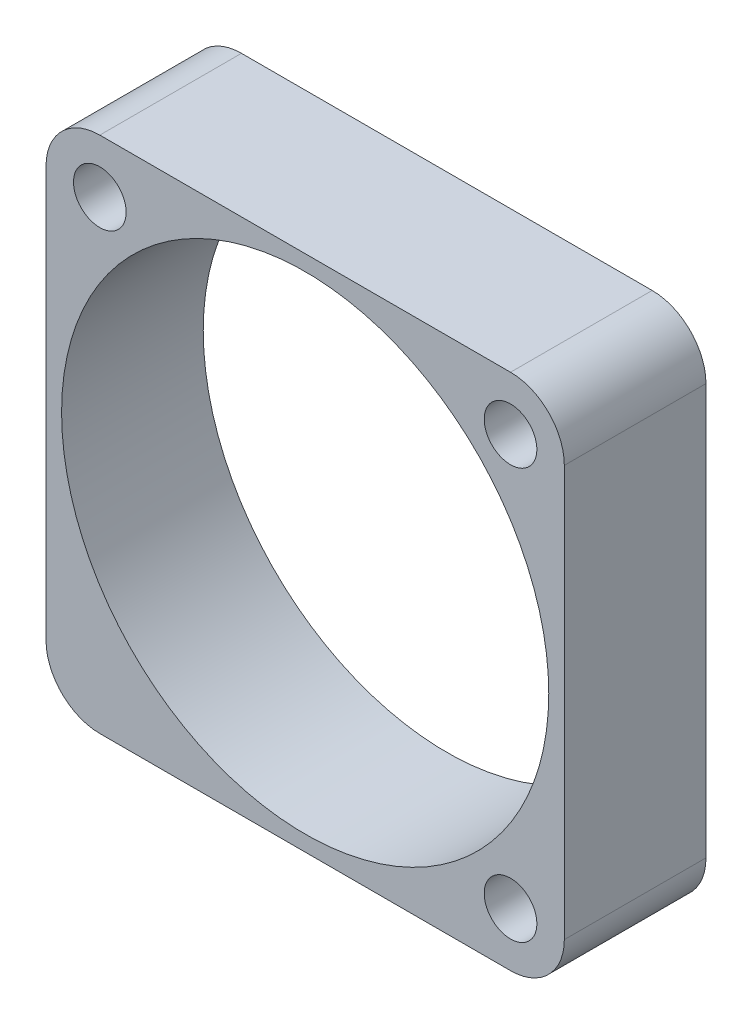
from build123d import *

# Parameters (mm, degrees)
SKETCH1_W           = 25
SKETCH1_H           = 25
BOSS_EXTRUDE1_DEPTH = 6.8325
SKETCH2_R           = 11.75
CUT_EXTRUDE1_DEPTH  = 37.009485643
SKETCH3_R           = 1.27
CUT_EXTRUDE2_DEPTH  = 37.009485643
CUT_EXTRUDE3_DEPTH  = 37.009485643


with BuildPart() as part:
    # Sketch1 → Boss-Extrude1 (new body)
    with BuildSketch(Plane.XY):
        with Locations((12.5, 12.5)):
            Rectangle(SKETCH1_W, SKETCH1_H)
    extrude(amount=BOSS_EXTRUDE1_DEPTH)

    # Sketch2 → Cut-Extrude1 (cut, through all)
    with BuildSketch(Plane.XY.offset(6.8325)):
        with Locations((12.5, 12.5)):
            Circle(SKETCH2_R)
    extrude(amount=-CUT_EXTRUDE1_DEPTH, mode=Mode.SUBTRACT)

    # Sketch3 → Cut-Extrude2 (cut, through all)
    with BuildSketch(Plane.XY.offset(6.8325)):
        with Locations((2.594, 22.406)):
            Circle(SKETCH3_R)
        with Locations((22.406, 22.406)):
            Circle(SKETCH3_R)
        with Locations((22.406, 2.594)):
            Circle(SKETCH3_R)
    extrude(amount=-CUT_EXTRUDE2_DEPTH, mode=Mode.SUBTRACT)

    # Sketch4 → Cut-Extrude3 (cut, through all)
    with BuildSketch(Plane.XY.offset(6.8325)):
        with BuildLine():
            Line((22.406, 25), (25, 25))
            Line((25, 25), (25, 22.406))
            ThreePointArc((25, 22.406), (24.24023499, 24.24023499), (22.406, 25))
        make_face()
        with BuildLine():
            Line((25, 2.594), (25, 0))
            Line((25, 0), (22.406, 0))
            ThreePointArc((22.406, 0), (24.24023499, 0.75976501), (25, 2.594))
        make_face()
        with BuildLine():
            Line((2.594, 0), (0, 0))
            Line((0, 0), (0, 2.594))
            ThreePointArc((0, 2.594), (0.75976501, 0.75976501), (2.594, 0))
        make_face()
        with BuildLine():
            Line((0, 22.406), (0, 25))
            Line((0, 25), (2.594, 25))
            ThreePointArc((2.594, 25), (0.75976501, 24.24023499), (0, 22.406))
        make_face()
    extrude(amount=-CUT_EXTRUDE3_DEPTH, mode=Mode.SUBTRACT)


solid = part.part
